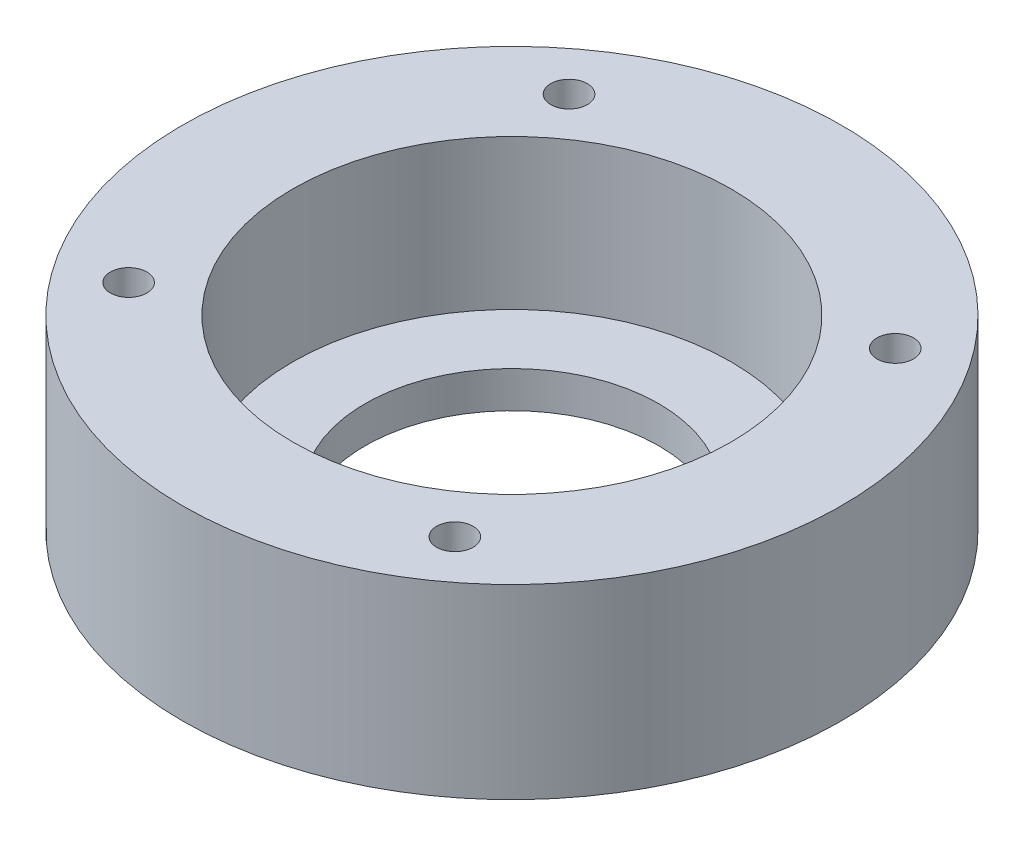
from build123d import *

# Parameters (mm, degrees)
TROU_TARAUD_M61_D            = 5
R_P_TITION_CIRCULAIRE1_COUNT = 4


with BuildPart() as part:
    # Esquisse1 → R_volution1 (revolve)
    with BuildSketch(Plane.XY, mode=Mode.PRIVATE) as r_volution1_sk:
        Polygon((20.1, 0), (45.1, 0), (45.1, 25.5), (30, 25.5), (30, 5), (20.1, 5), align=None)
    revolve(r_volution1_sk.sketch.rotate(Axis((0, 77.602610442, 0), (0, -1, 0)), 90), axis=Axis((0, 77.602610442, 0), (0, -1, 0)))

    # Trou taraud_ M61 (through all)
    with Locations(Plane.XZ):
        with Locations((-22.321761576, -30.132855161)):
            trou_taraud_m61 = Hole(TROU_TARAUD_M61_D / 2)

    # R_p_tition circulaire1: Trou taraud_ M61 ×4 about axis
    r_p_tition_circulaire1_axis = Axis((0, 0, 0), (0, 1, 0))
    for i in range(1, R_P_TITION_CIRCULAIRE1_COUNT):
        add(trou_taraud_m61.rotate(r_p_tition_circulaire1_axis, i * 360 / R_P_TITION_CIRCULAIRE1_COUNT), mode=Mode.SUBTRACT)


solid = part.part
